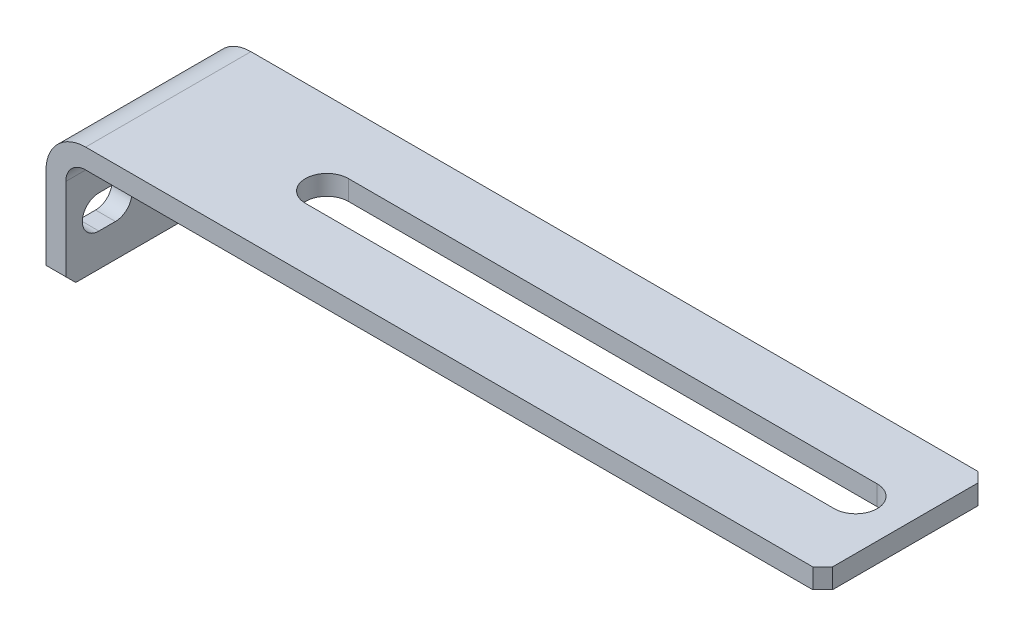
ISO-10303-21;
HEADER;
FILE_DESCRIPTION(('STEP AP214'),'2;1');
FILE_NAME('part.step','',(''),(''),'','','');
FILE_SCHEMA(('AUTOMOTIVE_DESIGN { 1 0 10303 214 1 1 1 1 }'));
ENDSEC;
DATA;
#1=APPLICATION_CONTEXT('core data for automotive mechanical design processes');
#2=APPLICATION_PROTOCOL_DEFINITION('international standard','automotive_design',2000,#1);
#3=PRODUCT_CONTEXT('',#1,'mechanical');
#4=PRODUCT('Part','Part','',(#3));
#5=PRODUCT_RELATED_PRODUCT_CATEGORY('part','',(#4));
#6=PRODUCT_DEFINITION_FORMATION('','',#4);
#7=PRODUCT_DEFINITION_CONTEXT('part definition',#1,'design');
#8=PRODUCT_DEFINITION('design','',#6,#7);
#9=PRODUCT_DEFINITION_SHAPE('','',#8);
#10=(LENGTH_UNIT() NAMED_UNIT(*) SI_UNIT(.MILLI.,.METRE.));
#11=(NAMED_UNIT(*) PLANE_ANGLE_UNIT() SI_UNIT($,.RADIAN.));
#12=(NAMED_UNIT(*) SI_UNIT($,.STERADIAN.) SOLID_ANGLE_UNIT());
#13=UNCERTAINTY_MEASURE_WITH_UNIT(LENGTH_MEASURE(1.E-05),#10,'distance_accuracy_value','');
#14=(GEOMETRIC_REPRESENTATION_CONTEXT(3) GLOBAL_UNCERTAINTY_ASSIGNED_CONTEXT((#13)) GLOBAL_UNIT_ASSIGNED_CONTEXT((#10,
#11,#12)) REPRESENTATION_CONTEXT('',''));
#15=CARTESIAN_POINT('',(0.,0.,0.));
#16=DIRECTION('',(0.,0.,1.));
#17=DIRECTION('',(1.,0.,0.));
#18=AXIS2_PLACEMENT_3D('',#15,#16,#17);
#19=CARTESIAN_POINT('',(111.5,0.,25.));
#20=DIRECTION('',(-1.,0.,0.));
#21=DIRECTION('',(0.,-1.,0.));
#22=AXIS2_PLACEMENT_3D('',#19,#20,#21);
#23=PLANE('',#22);
#24=DIRECTION('',(0.,0.,-1.));
#25=VECTOR('',#24,1.);
#26=CARTESIAN_POINT('',(111.5,-6.,25.));
#27=LINE('',#26,#25);
#28=CARTESIAN_POINT('',(111.5,-6.,22.));
#29=VERTEX_POINT('',#28);
#30=CARTESIAN_POINT('',(111.5,-6.,-22.));
#31=VERTEX_POINT('',#30);
#32=EDGE_CURVE('E300',#29,#31,#27,.T.);
#33=ORIENTED_EDGE('',*,*,#32,.T.);
#34=DIRECTION('',(0.,1.,0.));
#35=VECTOR('',#34,1.);
#36=CARTESIAN_POINT('',(111.5,0.,-22.));
#37=LINE('',#36,#35);
#38=CARTESIAN_POINT('',(111.5,0.,-22.));
#39=VERTEX_POINT('',#38);
#40=EDGE_CURVE('E349',#31,#39,#37,.T.);
#41=ORIENTED_EDGE('',*,*,#40,.T.);
#42=DIRECTION('',(0.,0.,-1.));
#43=VECTOR('',#42,1.);
#44=CARTESIAN_POINT('',(111.5,0.,25.));
#45=LINE('',#44,#43);
#46=CARTESIAN_POINT('',(111.5,0.,22.));
#47=VERTEX_POINT('',#46);
#48=EDGE_CURVE('E321',#47,#39,#45,.T.);
#49=ORIENTED_EDGE('',*,*,#48,.F.);
#50=DIRECTION('',(0.,-1.,0.));
#51=VECTOR('',#50,1.);
#52=CARTESIAN_POINT('',(111.5,0.,22.));
#53=LINE('',#52,#51);
#54=EDGE_CURVE('E347',#47,#29,#53,.T.);
#55=ORIENTED_EDGE('',*,*,#54,.T.);
#56=EDGE_LOOP('',(#33,#41,#49,#55));
#57=FACE_BOUND('',#56,.T.);
#58=ADVANCED_FACE('F23',(#57),#23,.F.);
#59=CARTESIAN_POINT('',(-111.5,0.,25.));
#60=DIRECTION('',(0.,-1.,0.));
#61=DIRECTION('',(1.,0.,0.));
#62=AXIS2_PLACEMENT_3D('',#59,#60,#61);
#63=PLANE('',#62);
#64=DIRECTION('',(-1.,0.,0.));
#65=VECTOR('',#64,1.);
#66=CARTESIAN_POINT('',(96.5,0.,-6.5));
#67=LINE('',#66,#65);
#68=CARTESIAN_POINT('',(96.5,0.,-6.5));
#69=VERTEX_POINT('',#68);
#70=CARTESIAN_POINT('',(-63.5,0.,-6.5));
#71=VERTEX_POINT('',#70);
#72=EDGE_CURVE('E254',#69,#71,#67,.T.);
#73=ORIENTED_EDGE('',*,*,#72,.F.);
#74=CARTESIAN_POINT('',(96.5,0.,0.));
#75=DIRECTION('',(0.,1.,0.));
#76=DIRECTION('',(-1.,0.,0.));
#77=AXIS2_PLACEMENT_3D('',#74,#75,#76);
#78=CIRCLE('',#77,6.5);
#79=CARTESIAN_POINT('',(96.5,0.,6.5));
#80=VERTEX_POINT('',#79);
#81=EDGE_CURVE('E252',#80,#69,#78,.T.);
#82=ORIENTED_EDGE('',*,*,#81,.F.);
#83=DIRECTION('',(1.,0.,0.));
#84=VECTOR('',#83,1.);
#85=CARTESIAN_POINT('',(-63.5,0.,6.5));
#86=LINE('',#85,#84);
#87=CARTESIAN_POINT('',(-63.5,0.,6.5));
#88=VERTEX_POINT('',#87);
#89=EDGE_CURVE('E260',#88,#80,#86,.T.);
#90=ORIENTED_EDGE('',*,*,#89,.F.);
#91=CARTESIAN_POINT('',(-63.5,0.,0.));
#92=DIRECTION('',(0.,1.,0.));
#93=DIRECTION('',(-1.,0.,0.));
#94=AXIS2_PLACEMENT_3D('',#91,#92,#93);
#95=CIRCLE('',#94,6.5);
#96=EDGE_CURVE('E257',#71,#88,#95,.T.);
#97=ORIENTED_EDGE('',*,*,#96,.F.);
#98=EDGE_LOOP('',(#73,#82,#90,#97));
#99=FACE_BOUND('',#98,.T.);
#100=ORIENTED_EDGE('',*,*,#48,.T.);
#101=DIRECTION('',(-0.707106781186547,0.,-0.707106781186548));
#102=VECTOR('',#101,1.);
#103=CARTESIAN_POINT('',(111.5,0.,-22.));
#104=LINE('',#103,#102);
#105=CARTESIAN_POINT('',(108.5,0.,-25.));
#106=VERTEX_POINT('',#105);
#107=EDGE_CURVE('E354',#39,#106,#104,.T.);
#108=ORIENTED_EDGE('',*,*,#107,.T.);
#109=DIRECTION('',(-1.,0.,0.));
#110=VECTOR('',#109,1.);
#111=CARTESIAN_POINT('',(-111.5,0.,-25.));
#112=LINE('',#111,#110);
#113=CARTESIAN_POINT('',(-111.5,0.,-25.));
#114=VERTEX_POINT('',#113);
#115=EDGE_CURVE('E266',#106,#114,#112,.T.);
#116=ORIENTED_EDGE('',*,*,#115,.T.);
#117=DIRECTION('',(0.,0.,-1.));
#118=VECTOR('',#117,1.);
#119=CARTESIAN_POINT('',(-111.5,0.,25.));
#120=LINE('',#119,#118);
#121=CARTESIAN_POINT('',(-111.5,0.,25.));
#122=VERTEX_POINT('',#121);
#123=EDGE_CURVE('E318',#122,#114,#120,.T.);
#124=ORIENTED_EDGE('',*,*,#123,.F.);
#125=DIRECTION('',(-1.,0.,0.));
#126=VECTOR('',#125,1.);
#127=CARTESIAN_POINT('',(-111.5,0.,25.));
#128=LINE('',#127,#126);
#129=CARTESIAN_POINT('',(108.5,0.,25.));
#130=VERTEX_POINT('',#129);
#131=EDGE_CURVE('E286',#130,#122,#128,.T.);
#132=ORIENTED_EDGE('',*,*,#131,.F.);
#133=DIRECTION('',(-0.707106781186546,0.,0.70710678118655));
#134=VECTOR('',#133,1.);
#135=CARTESIAN_POINT('',(108.5,0.,25.));
#136=LINE('',#135,#134);
#137=EDGE_CURVE('E352',#130,#47,#136,.F.);
#138=ORIENTED_EDGE('',*,*,#137,.T.);
#139=EDGE_LOOP('',(#100,#108,#116,#124,#132,#138));
#140=FACE_BOUND('',#139,.T.);
#141=ADVANCED_FACE('F381',(#99,#140),#63,.F.);
#142=CARTESIAN_POINT('',(-111.5,-12.,25.));
#143=DIRECTION('',(0.,0.,-1.));
#144=DIRECTION('',(-1.,0.,0.));
#145=AXIS2_PLACEMENT_3D('',#142,#143,#144);
#146=CYLINDRICAL_SURFACE('',#145,12.);
#147=CARTESIAN_POINT('',(-111.5,-12.,-25.));
#148=DIRECTION('',(0.,0.,1.));
#149=DIRECTION('',(-1.,0.,0.));
#150=AXIS2_PLACEMENT_3D('',#147,#148,#149);
#151=CIRCLE('',#150,12.);
#152=CARTESIAN_POINT('',(-123.5,-12.,-25.));
#153=VERTEX_POINT('',#152);
#154=EDGE_CURVE('E274',#114,#153,#151,.T.);
#155=ORIENTED_EDGE('',*,*,#154,.T.);
#156=DIRECTION('',(0.,0.,-1.));
#157=VECTOR('',#156,1.);
#158=CARTESIAN_POINT('',(-123.5,-12.,25.));
#159=LINE('',#158,#157);
#160=CARTESIAN_POINT('',(-123.5,-12.,25.));
#161=VERTEX_POINT('',#160);
#162=EDGE_CURVE('E315',#161,#153,#159,.T.);
#163=ORIENTED_EDGE('',*,*,#162,.F.);
#164=CARTESIAN_POINT('',(-111.5,-12.,25.));
#165=DIRECTION('',(0.,0.,1.));
#166=DIRECTION('',(-1.,0.,0.));
#167=AXIS2_PLACEMENT_3D('',#164,#165,#166);
#168=CIRCLE('',#167,12.);
#169=EDGE_CURVE('E288',#122,#161,#168,.T.);
#170=ORIENTED_EDGE('',*,*,#169,.F.);
#171=ORIENTED_EDGE('',*,*,#123,.T.);
#172=EDGE_LOOP('',(#155,#163,#170,#171));
#173=FACE_BOUND('',#172,.T.);
#174=ADVANCED_FACE('F408',(#173),#146,.T.);
#175=CARTESIAN_POINT('',(-123.5,-40.,25.));
#176=DIRECTION('',(1.,0.,0.));
#177=DIRECTION('',(0.,0.,-1.));
#178=AXIS2_PLACEMENT_3D('',#175,#176,#177);
#179=PLANE('',#178);
#180=DIRECTION('',(0.,0.,1.));
#181=VECTOR('',#180,1.);
#182=CARTESIAN_POINT('',(-123.5,-20.,25.));
#183=LINE('',#182,#181);
#184=CARTESIAN_POINT('',(-123.5,-20.,-15.));
#185=VERTEX_POINT('',#184);
#186=CARTESIAN_POINT('',(-123.5,-20.,-10.));
#187=VERTEX_POINT('',#186);
#188=EDGE_CURVE('E214',#185,#187,#183,.T.);
#189=ORIENTED_EDGE('',*,*,#188,.T.);
#190=CARTESIAN_POINT('',(-123.5,-25.,-10.));
#191=DIRECTION('',(1.,0.,0.));
#192=DIRECTION('',(0.,0.,-1.));
#193=AXIS2_PLACEMENT_3D('',#190,#191,#192);
#194=CIRCLE('',#193,5.);
#195=CARTESIAN_POINT('',(-123.5,-30.,-10.));
#196=VERTEX_POINT('',#195);
#197=EDGE_CURVE('E217',#187,#196,#194,.T.);
#198=ORIENTED_EDGE('',*,*,#197,.T.);
#199=DIRECTION('',(0.,0.,-1.));
#200=VECTOR('',#199,1.);
#201=CARTESIAN_POINT('',(-123.5,-30.,25.));
#202=LINE('',#201,#200);
#203=CARTESIAN_POINT('',(-123.5,-30.,-15.));
#204=VERTEX_POINT('',#203);
#205=EDGE_CURVE('E209',#196,#204,#202,.T.);
#206=ORIENTED_EDGE('',*,*,#205,.T.);
#207=CARTESIAN_POINT('',(-123.5,-25.,-15.));
#208=DIRECTION('',(1.,0.,0.));
#209=DIRECTION('',(0.,0.,-1.));
#210=AXIS2_PLACEMENT_3D('',#207,#208,#209);
#211=CIRCLE('',#210,5.);
#212=EDGE_CURVE('E189',#204,#185,#211,.T.);
#213=ORIENTED_EDGE('',*,*,#212,.T.);
#214=EDGE_LOOP('',(#189,#198,#206,#213));
#215=FACE_BOUND('',#214,.T.);
#216=DIRECTION('',(0.,0.,1.));
#217=VECTOR('',#216,1.);
#218=CARTESIAN_POINT('',(-123.5,-20.,25.));
#219=LINE('',#218,#217);
#220=CARTESIAN_POINT('',(-123.5,-20.,10.));
#221=VERTEX_POINT('',#220);
#222=CARTESIAN_POINT('',(-123.5,-20.,15.));
#223=VERTEX_POINT('',#222);
#224=EDGE_CURVE('E246',#221,#223,#219,.T.);
#225=ORIENTED_EDGE('',*,*,#224,.T.);
#226=CARTESIAN_POINT('',(-123.5,-25.,15.));
#227=DIRECTION('',(1.,0.,0.));
#228=DIRECTION('',(0.,0.,-1.));
#229=AXIS2_PLACEMENT_3D('',#226,#227,#228);
#230=CIRCLE('',#229,5.);
#231=CARTESIAN_POINT('',(-123.5,-30.,15.));
#232=VERTEX_POINT('',#231);
#233=EDGE_CURVE('E249',#223,#232,#230,.T.);
#234=ORIENTED_EDGE('',*,*,#233,.T.);
#235=DIRECTION('',(0.,0.,-1.));
#236=VECTOR('',#235,1.);
#237=CARTESIAN_POINT('',(-123.5,-30.,25.));
#238=LINE('',#237,#236);
#239=CARTESIAN_POINT('',(-123.5,-30.,10.));
#240=VERTEX_POINT('',#239);
#241=EDGE_CURVE('E234',#232,#240,#238,.T.);
#242=ORIENTED_EDGE('',*,*,#241,.T.);
#243=CARTESIAN_POINT('',(-123.5,-25.,10.));
#244=DIRECTION('',(1.,0.,0.));
#245=DIRECTION('',(0.,0.,-1.));
#246=AXIS2_PLACEMENT_3D('',#243,#244,#245);
#247=CIRCLE('',#246,5.);
#248=EDGE_CURVE('E243',#240,#221,#247,.T.);
#249=ORIENTED_EDGE('',*,*,#248,.T.);
#250=EDGE_LOOP('',(#225,#234,#242,#249));
#251=FACE_BOUND('',#250,.T.);
#252=DIRECTION('',(0.,-1.,0.));
#253=VECTOR('',#252,1.);
#254=CARTESIAN_POINT('',(-123.5,-40.,-25.));
#255=LINE('',#254,#253);
#256=CARTESIAN_POINT('',(-123.5,-37.,-25.));
#257=VERTEX_POINT('',#256);
#258=EDGE_CURVE('E276',#153,#257,#255,.T.);
#259=ORIENTED_EDGE('',*,*,#258,.T.);
#260=DIRECTION('',(0.,-0.707106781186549,0.707106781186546));
#261=VECTOR('',#260,1.);
#262=CARTESIAN_POINT('',(-123.5,-40.,-22.));
#263=LINE('',#262,#261);
#264=CARTESIAN_POINT('',(-123.5,-40.,-22.));
#265=VERTEX_POINT('',#264);
#266=EDGE_CURVE('E339',#257,#265,#263,.T.);
#267=ORIENTED_EDGE('',*,*,#266,.T.);
#268=DIRECTION('',(0.,0.,-1.));
#269=VECTOR('',#268,1.);
#270=CARTESIAN_POINT('',(-123.5,-40.,25.));
#271=LINE('',#270,#269);
#272=CARTESIAN_POINT('',(-123.5,-40.,22.));
#273=VERTEX_POINT('',#272);
#274=EDGE_CURVE('E312',#273,#265,#271,.T.);
#275=ORIENTED_EDGE('',*,*,#274,.F.);
#276=DIRECTION('',(0.,-0.707106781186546,-0.70710678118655));
#277=VECTOR('',#276,1.);
#278=CARTESIAN_POINT('',(-123.5,-37.,25.));
#279=LINE('',#278,#277);
#280=CARTESIAN_POINT('',(-123.5,-37.,25.));
#281=VERTEX_POINT('',#280);
#282=EDGE_CURVE('E337',#273,#281,#279,.F.);
#283=ORIENTED_EDGE('',*,*,#282,.T.);
#284=DIRECTION('',(0.,-1.,0.));
#285=VECTOR('',#284,1.);
#286=CARTESIAN_POINT('',(-123.5,-40.,25.));
#287=LINE('',#286,#285);
#288=EDGE_CURVE('E290',#161,#281,#287,.T.);
#289=ORIENTED_EDGE('',*,*,#288,.F.);
#290=ORIENTED_EDGE('',*,*,#162,.T.);
#291=EDGE_LOOP('',(#259,#267,#275,#283,#289,#290));
#292=FACE_BOUND('',#291,.T.);
#293=ADVANCED_FACE('F431',(#215,#251,#292),#179,.F.);
#294=CARTESIAN_POINT('',(-117.5,-40.,25.));
#295=DIRECTION('',(0.,1.,0.));
#296=DIRECTION('',(0.,0.,1.));
#297=AXIS2_PLACEMENT_3D('',#294,#295,#296);
#298=PLANE('',#297);
#299=ORIENTED_EDGE('',*,*,#274,.T.);
#300=DIRECTION('',(1.,0.,0.));
#301=VECTOR('',#300,1.);
#302=CARTESIAN_POINT('',(-117.5,-40.,-22.));
#303=LINE('',#302,#301);
#304=CARTESIAN_POINT('',(-117.5,-40.,-22.));
#305=VERTEX_POINT('',#304);
#306=EDGE_CURVE('E326',#265,#305,#303,.T.);
#307=ORIENTED_EDGE('',*,*,#306,.T.);
#308=DIRECTION('',(0.,0.,-1.));
#309=VECTOR('',#308,1.);
#310=CARTESIAN_POINT('',(-117.5,-40.,25.));
#311=LINE('',#310,#309);
#312=CARTESIAN_POINT('',(-117.5,-40.,22.));
#313=VERTEX_POINT('',#312);
#314=EDGE_CURVE('E309',#313,#305,#311,.T.);
#315=ORIENTED_EDGE('',*,*,#314,.F.);
#316=DIRECTION('',(-1.,0.,0.));
#317=VECTOR('',#316,1.);
#318=CARTESIAN_POINT('',(-117.5,-40.,22.));
#319=LINE('',#318,#317);
#320=EDGE_CURVE('E324',#313,#273,#319,.T.);
#321=ORIENTED_EDGE('',*,*,#320,.T.);
#322=EDGE_LOOP('',(#299,#307,#315,#321));
#323=FACE_BOUND('',#322,.T.);
#324=ADVANCED_FACE('F446',(#323),#298,.F.);
#325=CARTESIAN_POINT('',(-117.5,-12.,25.));
#326=DIRECTION('',(-1.,0.,0.));
#327=DIRECTION('',(0.,0.,1.));
#328=AXIS2_PLACEMENT_3D('',#325,#326,#327);
#329=PLANE('',#328);
#330=DIRECTION('',(0.,0.,-1.));
#331=VECTOR('',#330,1.);
#332=CARTESIAN_POINT('',(-117.5,-30.,-10.));
#333=LINE('',#332,#331);
#334=CARTESIAN_POINT('',(-117.5,-30.,-10.));
#335=VERTEX_POINT('',#334);
#336=CARTESIAN_POINT('',(-117.5,-30.,-15.));
#337=VERTEX_POINT('',#336);
#338=EDGE_CURVE('E195',#335,#337,#333,.T.);
#339=ORIENTED_EDGE('',*,*,#338,.F.);
#340=CARTESIAN_POINT('',(-117.5,-25.,-10.));
#341=DIRECTION('',(1.,0.,0.));
#342=DIRECTION('',(0.,0.,-1.));
#343=AXIS2_PLACEMENT_3D('',#340,#341,#342);
#344=CIRCLE('',#343,5.);
#345=CARTESIAN_POINT('',(-117.5,-20.,-10.));
#346=VERTEX_POINT('',#345);
#347=EDGE_CURVE('E45',#346,#335,#344,.T.);
#348=ORIENTED_EDGE('',*,*,#347,.F.);
#349=DIRECTION('',(0.,0.,1.));
#350=VECTOR('',#349,1.);
#351=CARTESIAN_POINT('',(-117.5,-20.,-15.));
#352=LINE('',#351,#350);
#353=CARTESIAN_POINT('',(-117.5,-20.,-15.));
#354=VERTEX_POINT('',#353);
#355=EDGE_CURVE('E202',#354,#346,#352,.T.);
#356=ORIENTED_EDGE('',*,*,#355,.F.);
#357=CARTESIAN_POINT('',(-117.5,-25.,-15.));
#358=DIRECTION('',(1.,0.,0.));
#359=DIRECTION('',(0.,0.,-1.));
#360=AXIS2_PLACEMENT_3D('',#357,#358,#359);
#361=CIRCLE('',#360,5.);
#362=EDGE_CURVE('E186',#337,#354,#361,.T.);
#363=ORIENTED_EDGE('',*,*,#362,.F.);
#364=EDGE_LOOP('',(#339,#348,#356,#363));
#365=FACE_BOUND('',#364,.T.);
#366=DIRECTION('',(0.,0.,-1.));
#367=VECTOR('',#366,1.);
#368=CARTESIAN_POINT('',(-117.5,-30.,15.));
#369=LINE('',#368,#367);
#370=CARTESIAN_POINT('',(-117.5,-30.,15.));
#371=VERTEX_POINT('',#370);
#372=CARTESIAN_POINT('',(-117.5,-30.,10.));
#373=VERTEX_POINT('',#372);
#374=EDGE_CURVE('E222',#371,#373,#369,.T.);
#375=ORIENTED_EDGE('',*,*,#374,.F.);
#376=CARTESIAN_POINT('',(-117.5,-25.,15.));
#377=DIRECTION('',(1.,0.,0.));
#378=DIRECTION('',(0.,0.,-1.));
#379=AXIS2_PLACEMENT_3D('',#376,#377,#378);
#380=CIRCLE('',#379,5.);
#381=CARTESIAN_POINT('',(-117.5,-20.,15.));
#382=VERTEX_POINT('',#381);
#383=EDGE_CURVE('E220',#382,#371,#380,.T.);
#384=ORIENTED_EDGE('',*,*,#383,.F.);
#385=DIRECTION('',(0.,0.,1.));
#386=VECTOR('',#385,1.);
#387=CARTESIAN_POINT('',(-117.5,-20.,10.));
#388=LINE('',#387,#386);
#389=CARTESIAN_POINT('',(-117.5,-20.,10.));
#390=VERTEX_POINT('',#389);
#391=EDGE_CURVE('E228',#390,#382,#388,.T.);
#392=ORIENTED_EDGE('',*,*,#391,.F.);
#393=CARTESIAN_POINT('',(-117.5,-25.,10.));
#394=DIRECTION('',(1.,0.,0.));
#395=DIRECTION('',(0.,0.,-1.));
#396=AXIS2_PLACEMENT_3D('',#393,#394,#395);
#397=CIRCLE('',#396,5.);
#398=EDGE_CURVE('E225',#373,#390,#397,.T.);
#399=ORIENTED_EDGE('',*,*,#398,.F.);
#400=EDGE_LOOP('',(#375,#384,#392,#399));
#401=FACE_BOUND('',#400,.T.);
#402=ORIENTED_EDGE('',*,*,#314,.T.);
#403=DIRECTION('',(0.,0.707106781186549,-0.707106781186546));
#404=VECTOR('',#403,1.);
#405=CARTESIAN_POINT('',(-117.5,-40.,-22.));
#406=LINE('',#405,#404);
#407=CARTESIAN_POINT('',(-117.5,-37.,-25.));
#408=VERTEX_POINT('',#407);
#409=EDGE_CURVE('E331',#305,#408,#406,.T.);
#410=ORIENTED_EDGE('',*,*,#409,.T.);
#411=DIRECTION('',(0.,1.,0.));
#412=VECTOR('',#411,1.);
#413=CARTESIAN_POINT('',(-117.5,-12.,-25.));
#414=LINE('',#413,#412);
#415=CARTESIAN_POINT('',(-117.5,-12.,-25.));
#416=VERTEX_POINT('',#415);
#417=EDGE_CURVE('E279',#408,#416,#414,.T.);
#418=ORIENTED_EDGE('',*,*,#417,.T.);
#419=DIRECTION('',(0.,0.,-1.));
#420=VECTOR('',#419,1.);
#421=CARTESIAN_POINT('',(-117.5,-12.,25.));
#422=LINE('',#421,#420);
#423=CARTESIAN_POINT('',(-117.5,-12.,25.));
#424=VERTEX_POINT('',#423);
#425=EDGE_CURVE('E306',#424,#416,#422,.T.);
#426=ORIENTED_EDGE('',*,*,#425,.F.);
#427=DIRECTION('',(0.,1.,0.));
#428=VECTOR('',#427,1.);
#429=CARTESIAN_POINT('',(-117.5,-12.,25.));
#430=LINE('',#429,#428);
#431=CARTESIAN_POINT('',(-117.5,-37.,25.));
#432=VERTEX_POINT('',#431);
#433=EDGE_CURVE('E293',#432,#424,#430,.T.);
#434=ORIENTED_EDGE('',*,*,#433,.F.);
#435=DIRECTION('',(0.,0.707106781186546,0.70710678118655));
#436=VECTOR('',#435,1.);
#437=CARTESIAN_POINT('',(-117.5,-37.,25.));
#438=LINE('',#437,#436);
#439=EDGE_CURVE('E329',#432,#313,#438,.F.);
#440=ORIENTED_EDGE('',*,*,#439,.T.);
#441=EDGE_LOOP('',(#402,#410,#418,#426,#434,#440));
#442=FACE_BOUND('',#441,.T.);
#443=ADVANCED_FACE('F199',(#365,#401,#442),#329,.F.);
#444=CARTESIAN_POINT('',(-111.5,-12.,25.));
#445=DIRECTION('',(0.,0.,-1.));
#446=DIRECTION('',(-1.,0.,0.));
#447=AXIS2_PLACEMENT_3D('',#444,#445,#446);
#448=CYLINDRICAL_SURFACE('',#447,6.);
#449=CARTESIAN_POINT('',(-111.5,-12.,-25.));
#450=DIRECTION('',(0.,0.,-1.));
#451=DIRECTION('',(-1.,0.,0.));
#452=AXIS2_PLACEMENT_3D('',#449,#450,#451);
#453=CIRCLE('',#452,6.);
#454=CARTESIAN_POINT('',(-111.5,-6.,-25.));
#455=VERTEX_POINT('',#454);
#456=EDGE_CURVE('E281',#416,#455,#453,.T.);
#457=ORIENTED_EDGE('',*,*,#456,.T.);
#458=DIRECTION('',(0.,0.,-1.));
#459=VECTOR('',#458,1.);
#460=CARTESIAN_POINT('',(-111.5,-6.,25.));
#461=LINE('',#460,#459);
#462=CARTESIAN_POINT('',(-111.5,-6.,25.));
#463=VERTEX_POINT('',#462);
#464=EDGE_CURVE('E303',#463,#455,#461,.T.);
#465=ORIENTED_EDGE('',*,*,#464,.F.);
#466=CARTESIAN_POINT('',(-111.5,-12.,25.));
#467=DIRECTION('',(0.,0.,-1.));
#468=DIRECTION('',(-1.,0.,0.));
#469=AXIS2_PLACEMENT_3D('',#466,#467,#468);
#470=CIRCLE('',#469,6.);
#471=EDGE_CURVE('E295',#424,#463,#470,.T.);
#472=ORIENTED_EDGE('',*,*,#471,.F.);
#473=ORIENTED_EDGE('',*,*,#425,.T.);
#474=EDGE_LOOP('',(#457,#465,#472,#473));
#475=FACE_BOUND('',#474,.T.);
#476=ADVANCED_FACE('F454',(#475),#448,.F.);
#477=CARTESIAN_POINT('',(111.5,-6.,25.));
#478=DIRECTION('',(0.,1.,0.));
#479=DIRECTION('',(-1.,0.,0.));
#480=AXIS2_PLACEMENT_3D('',#477,#478,#479);
#481=PLANE('',#480);
#482=DIRECTION('',(1.,0.,0.));
#483=VECTOR('',#482,1.);
#484=CARTESIAN_POINT('',(111.5,-6.,6.5));
#485=LINE('',#484,#483);
#486=CARTESIAN_POINT('',(-63.5,-6.,6.5));
#487=VERTEX_POINT('',#486);
#488=CARTESIAN_POINT('',(96.5,-6.,6.5));
#489=VERTEX_POINT('',#488);
#490=EDGE_CURVE('E30',#487,#489,#485,.T.);
#491=ORIENTED_EDGE('',*,*,#490,.T.);
#492=CARTESIAN_POINT('',(96.5,-6.,0.));
#493=DIRECTION('',(0.,1.,0.));
#494=DIRECTION('',(-1.,0.,0.));
#495=AXIS2_PLACEMENT_3D('',#492,#493,#494);
#496=CIRCLE('',#495,6.5);
#497=CARTESIAN_POINT('',(96.5,-6.,-6.5));
#498=VERTEX_POINT('',#497);
#499=EDGE_CURVE('E13',#489,#498,#496,.T.);
#500=ORIENTED_EDGE('',*,*,#499,.T.);
#501=DIRECTION('',(-1.,0.,0.));
#502=VECTOR('',#501,1.);
#503=CARTESIAN_POINT('',(111.5,-6.,-6.5));
#504=LINE('',#503,#502);
#505=CARTESIAN_POINT('',(-63.5,-6.,-6.5));
#506=VERTEX_POINT('',#505);
#507=EDGE_CURVE('E360',#498,#506,#504,.T.);
#508=ORIENTED_EDGE('',*,*,#507,.T.);
#509=CARTESIAN_POINT('',(-63.5,-6.,0.));
#510=DIRECTION('',(0.,1.,0.));
#511=DIRECTION('',(-1.,0.,0.));
#512=AXIS2_PLACEMENT_3D('',#509,#510,#511);
#513=CIRCLE('',#512,6.5);
#514=EDGE_CURVE('E363',#506,#487,#513,.T.);
#515=ORIENTED_EDGE('',*,*,#514,.T.);
#516=EDGE_LOOP('',(#491,#500,#508,#515));
#517=FACE_BOUND('',#516,.T.);
#518=DIRECTION('',(1.,0.,0.));
#519=VECTOR('',#518,1.);
#520=CARTESIAN_POINT('',(111.5,-6.,-25.));
#521=LINE('',#520,#519);
#522=CARTESIAN_POINT('',(108.5,-6.,-25.));
#523=VERTEX_POINT('',#522);
#524=EDGE_CURVE('E283',#455,#523,#521,.T.);
#525=ORIENTED_EDGE('',*,*,#524,.T.);
#526=DIRECTION('',(0.707106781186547,0.,0.707106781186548));
#527=VECTOR('',#526,1.);
#528=CARTESIAN_POINT('',(111.5,-6.,-22.));
#529=LINE('',#528,#527);
#530=EDGE_CURVE('E358',#523,#31,#529,.T.);
#531=ORIENTED_EDGE('',*,*,#530,.T.);
#532=ORIENTED_EDGE('',*,*,#32,.F.);
#533=DIRECTION('',(0.707106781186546,0.,-0.70710678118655));
#534=VECTOR('',#533,1.);
#535=CARTESIAN_POINT('',(108.5,-6.,25.));
#536=LINE('',#535,#534);
#537=CARTESIAN_POINT('',(108.5,-6.,25.));
#538=VERTEX_POINT('',#537);
#539=EDGE_CURVE('E356',#29,#538,#536,.F.);
#540=ORIENTED_EDGE('',*,*,#539,.T.);
#541=DIRECTION('',(1.,0.,0.));
#542=VECTOR('',#541,1.);
#543=CARTESIAN_POINT('',(111.5,-6.,25.));
#544=LINE('',#543,#542);
#545=EDGE_CURVE('E297',#463,#538,#544,.T.);
#546=ORIENTED_EDGE('',*,*,#545,.F.);
#547=ORIENTED_EDGE('',*,*,#464,.T.);
#548=EDGE_LOOP('',(#525,#531,#532,#540,#546,#547));
#549=FACE_BOUND('',#548,.T.);
#550=ADVANCED_FACE('F367',(#517,#549),#481,.F.);
#551=CARTESIAN_POINT('',(-111.5,-12.,25.));
#552=DIRECTION('',(0.,0.,-1.));
#553=DIRECTION('',(-1.,0.,0.));
#554=AXIS2_PLACEMENT_3D('',#551,#552,#553);
#555=PLANE('',#554);
#556=ORIENTED_EDGE('',*,*,#288,.T.);
#557=DIRECTION('',(1.,0.,0.));
#558=VECTOR('',#557,1.);
#559=CARTESIAN_POINT('',(-111.5,-37.,25.));
#560=LINE('',#559,#558);
#561=EDGE_CURVE('E344',#281,#432,#560,.T.);
#562=ORIENTED_EDGE('',*,*,#561,.T.);
#563=ORIENTED_EDGE('',*,*,#433,.T.);
#564=ORIENTED_EDGE('',*,*,#471,.T.);
#565=ORIENTED_EDGE('',*,*,#545,.T.);
#566=DIRECTION('',(0.,1.,0.));
#567=VECTOR('',#566,1.);
#568=CARTESIAN_POINT('',(108.5,-11.9999999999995,25.));
#569=LINE('',#568,#567);
#570=EDGE_CURVE('E341',#538,#130,#569,.T.);
#571=ORIENTED_EDGE('',*,*,#570,.T.);
#572=ORIENTED_EDGE('',*,*,#131,.T.);
#573=ORIENTED_EDGE('',*,*,#169,.T.);
#574=EDGE_LOOP('',(#556,#562,#563,#564,#565,#571,#572,#573));
#575=FACE_BOUND('',#574,.T.);
#576=ADVANCED_FACE('F437',(#575),#555,.F.);
#577=CARTESIAN_POINT('',(-111.5,-12.,-25.));
#578=DIRECTION('',(0.,0.,-1.));
#579=DIRECTION('',(-1.,0.,0.));
#580=AXIS2_PLACEMENT_3D('',#577,#578,#579);
#581=PLANE('',#580);
#582=ORIENTED_EDGE('',*,*,#417,.F.);
#583=DIRECTION('',(-1.,0.,0.));
#584=VECTOR('',#583,1.);
#585=CARTESIAN_POINT('',(-123.5,-37.,-25.));
#586=LINE('',#585,#584);
#587=EDGE_CURVE('E335',#408,#257,#586,.T.);
#588=ORIENTED_EDGE('',*,*,#587,.T.);
#589=ORIENTED_EDGE('',*,*,#258,.F.);
#590=ORIENTED_EDGE('',*,*,#154,.F.);
#591=ORIENTED_EDGE('',*,*,#115,.F.);
#592=DIRECTION('',(0.,-1.,0.));
#593=VECTOR('',#592,1.);
#594=CARTESIAN_POINT('',(108.5,-6.,-25.));
#595=LINE('',#594,#593);
#596=EDGE_CURVE('E333',#106,#523,#595,.T.);
#597=ORIENTED_EDGE('',*,*,#596,.T.);
#598=ORIENTED_EDGE('',*,*,#524,.F.);
#599=ORIENTED_EDGE('',*,*,#456,.F.);
#600=EDGE_LOOP('',(#582,#588,#589,#590,#591,#597,#598,#599));
#601=FACE_BOUND('',#600,.T.);
#602=ADVANCED_FACE('F423',(#601),#581,.T.);
#603=CARTESIAN_POINT('',(-117.5,-40.,-22.));
#604=DIRECTION('',(0.,-0.707106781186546,-0.707106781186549));
#605=DIRECTION('',(0.,0.707106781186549,-0.707106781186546));
#606=AXIS2_PLACEMENT_3D('',#603,#604,#605);
#607=PLANE('',#606);
#608=ORIENTED_EDGE('',*,*,#266,.F.);
#609=ORIENTED_EDGE('',*,*,#587,.F.);
#610=ORIENTED_EDGE('',*,*,#409,.F.);
#611=ORIENTED_EDGE('',*,*,#306,.F.);
#612=EDGE_LOOP('',(#608,#609,#610,#611));
#613=FACE_BOUND('',#612,.T.);
#614=ADVANCED_FACE('F449',(#613),#607,.T.);
#615=CARTESIAN_POINT('',(-111.5,-37.,25.));
#616=DIRECTION('',(0.,0.70710678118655,-0.707106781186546));
#617=DIRECTION('',(0.,0.707106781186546,0.70710678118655));
#618=AXIS2_PLACEMENT_3D('',#615,#616,#617);
#619=PLANE('',#618);
#620=ORIENTED_EDGE('',*,*,#282,.F.);
#621=ORIENTED_EDGE('',*,*,#320,.F.);
#622=ORIENTED_EDGE('',*,*,#439,.F.);
#623=ORIENTED_EDGE('',*,*,#561,.F.);
#624=EDGE_LOOP('',(#620,#621,#622,#623));
#625=FACE_BOUND('',#624,.T.);
#626=ADVANCED_FACE('F440',(#625),#619,.F.);
#627=CARTESIAN_POINT('',(111.5,0.,-22.));
#628=DIRECTION('',(0.707106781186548,0.,-0.707106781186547));
#629=DIRECTION('',(-0.707106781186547,0.,-0.707106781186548));
#630=AXIS2_PLACEMENT_3D('',#627,#628,#629);
#631=PLANE('',#630);
#632=ORIENTED_EDGE('',*,*,#530,.F.);
#633=ORIENTED_EDGE('',*,*,#596,.F.);
#634=ORIENTED_EDGE('',*,*,#107,.F.);
#635=ORIENTED_EDGE('',*,*,#40,.F.);
#636=EDGE_LOOP('',(#632,#633,#634,#635));
#637=FACE_BOUND('',#636,.T.);
#638=ADVANCED_FACE('F416',(#637),#631,.T.);
#639=CARTESIAN_POINT('',(108.5,-11.9999999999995,25.));
#640=DIRECTION('',(-0.70710678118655,0.,-0.707106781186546));
#641=DIRECTION('',(-0.707106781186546,0.,0.70710678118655));
#642=AXIS2_PLACEMENT_3D('',#639,#640,#641);
#643=PLANE('',#642);
#644=ORIENTED_EDGE('',*,*,#539,.F.);
#645=ORIENTED_EDGE('',*,*,#54,.F.);
#646=ORIENTED_EDGE('',*,*,#137,.F.);
#647=ORIENTED_EDGE('',*,*,#570,.F.);
#648=EDGE_LOOP('',(#644,#645,#646,#647));
#649=FACE_BOUND('',#648,.T.);
#650=ADVANCED_FACE('F460',(#649),#643,.F.);
#651=CARTESIAN_POINT('',(96.5,-50.,0.));
#652=DIRECTION('',(0.,1.,0.));
#653=DIRECTION('',(-1.,0.,0.));
#654=AXIS2_PLACEMENT_3D('',#651,#652,#653);
#655=CYLINDRICAL_SURFACE('',#654,6.5);
#656=DIRECTION('',(0.,1.,0.));
#657=VECTOR('',#656,1.);
#658=CARTESIAN_POINT('',(96.5,-50.,6.5));
#659=LINE('',#658,#657);
#660=EDGE_CURVE('E264',#489,#80,#659,.T.);
#661=ORIENTED_EDGE('',*,*,#660,.T.);
#662=ORIENTED_EDGE('',*,*,#81,.T.);
#663=DIRECTION('',(0.,1.,0.));
#664=VECTOR('',#663,1.);
#665=CARTESIAN_POINT('',(96.5,-50.,-6.5));
#666=LINE('',#665,#664);
#667=EDGE_CURVE('E263',#498,#69,#666,.T.);
#668=ORIENTED_EDGE('',*,*,#667,.F.);
#669=ORIENTED_EDGE('',*,*,#499,.F.);
#670=EDGE_LOOP('',(#661,#662,#668,#669));
#671=FACE_BOUND('',#670,.T.);
#672=ADVANCED_FACE('F385',(#671),#655,.F.);
#673=CARTESIAN_POINT('',(-63.5,-50.,6.5));
#674=DIRECTION('',(0.,0.,1.));
#675=DIRECTION('',(1.,0.,0.));
#676=AXIS2_PLACEMENT_3D('',#673,#674,#675);
#677=PLANE('',#676);
#678=DIRECTION('',(0.,1.,0.));
#679=VECTOR('',#678,1.);
#680=CARTESIAN_POINT('',(-63.5,-50.,6.5));
#681=LINE('',#680,#679);
#682=EDGE_CURVE('E267',#487,#88,#681,.T.);
#683=ORIENTED_EDGE('',*,*,#682,.T.);
#684=ORIENTED_EDGE('',*,*,#89,.T.);
#685=ORIENTED_EDGE('',*,*,#660,.F.);
#686=ORIENTED_EDGE('',*,*,#490,.F.);
#687=EDGE_LOOP('',(#683,#684,#685,#686));
#688=FACE_BOUND('',#687,.T.);
#689=ADVANCED_FACE('F373',(#688),#677,.F.);
#690=CARTESIAN_POINT('',(-63.5,-50.,0.));
#691=DIRECTION('',(0.,1.,0.));
#692=DIRECTION('',(-1.,0.,0.));
#693=AXIS2_PLACEMENT_3D('',#690,#691,#692);
#694=CYLINDRICAL_SURFACE('',#693,6.5);
#695=DIRECTION('',(0.,1.,0.));
#696=VECTOR('',#695,1.);
#697=CARTESIAN_POINT('',(-63.5,-50.,-6.5));
#698=LINE('',#697,#696);
#699=EDGE_CURVE('E269',#506,#71,#698,.T.);
#700=ORIENTED_EDGE('',*,*,#699,.T.);
#701=ORIENTED_EDGE('',*,*,#96,.T.);
#702=ORIENTED_EDGE('',*,*,#682,.F.);
#703=ORIENTED_EDGE('',*,*,#514,.F.);
#704=EDGE_LOOP('',(#700,#701,#702,#703));
#705=FACE_BOUND('',#704,.T.);
#706=ADVANCED_FACE('F375',(#705),#694,.F.);
#707=CARTESIAN_POINT('',(96.5,-50.,-6.5));
#708=DIRECTION('',(0.,0.,-1.));
#709=DIRECTION('',(-1.,0.,0.));
#710=AXIS2_PLACEMENT_3D('',#707,#708,#709);
#711=PLANE('',#710);
#712=ORIENTED_EDGE('',*,*,#667,.T.);
#713=ORIENTED_EDGE('',*,*,#72,.T.);
#714=ORIENTED_EDGE('',*,*,#699,.F.);
#715=ORIENTED_EDGE('',*,*,#507,.F.);
#716=EDGE_LOOP('',(#712,#713,#714,#715));
#717=FACE_BOUND('',#716,.T.);
#718=ADVANCED_FACE('F387',(#717),#711,.F.);
#719=CARTESIAN_POINT('',(-167.5,-25.,15.));
#720=DIRECTION('',(1.,0.,0.));
#721=DIRECTION('',(0.,0.,-1.));
#722=AXIS2_PLACEMENT_3D('',#719,#720,#721);
#723=CYLINDRICAL_SURFACE('',#722,5.);
#724=DIRECTION('',(1.,0.,0.));
#725=VECTOR('',#724,1.);
#726=CARTESIAN_POINT('',(-167.5,-20.,15.));
#727=LINE('',#726,#725);
#728=EDGE_CURVE('E232',#223,#382,#727,.T.);
#729=ORIENTED_EDGE('',*,*,#728,.T.);
#730=ORIENTED_EDGE('',*,*,#383,.T.);
#731=DIRECTION('',(1.,0.,0.));
#732=VECTOR('',#731,1.);
#733=CARTESIAN_POINT('',(-167.5,-30.,15.));
#734=LINE('',#733,#732);
#735=EDGE_CURVE('E231',#232,#371,#734,.T.);
#736=ORIENTED_EDGE('',*,*,#735,.F.);
#737=ORIENTED_EDGE('',*,*,#233,.F.);
#738=EDGE_LOOP('',(#729,#730,#736,#737));
#739=FACE_BOUND('',#738,.T.);
#740=ADVANCED_FACE('F389',(#739),#723,.F.);
#741=CARTESIAN_POINT('',(-167.5,-20.,10.));
#742=DIRECTION('',(0.,1.,0.));
#743=DIRECTION('',(0.,0.,1.));
#744=AXIS2_PLACEMENT_3D('',#741,#742,#743);
#745=PLANE('',#744);
#746=DIRECTION('',(1.,0.,0.));
#747=VECTOR('',#746,1.);
#748=CARTESIAN_POINT('',(-167.5,-20.,10.));
#749=LINE('',#748,#747);
#750=EDGE_CURVE('E235',#221,#390,#749,.T.);
#751=ORIENTED_EDGE('',*,*,#750,.T.);
#752=ORIENTED_EDGE('',*,*,#391,.T.);
#753=ORIENTED_EDGE('',*,*,#728,.F.);
#754=ORIENTED_EDGE('',*,*,#224,.F.);
#755=EDGE_LOOP('',(#751,#752,#753,#754));
#756=FACE_BOUND('',#755,.T.);
#757=ADVANCED_FACE('F397',(#756),#745,.F.);
#758=CARTESIAN_POINT('',(-167.5,-25.,10.));
#759=DIRECTION('',(1.,0.,0.));
#760=DIRECTION('',(0.,0.,-1.));
#761=AXIS2_PLACEMENT_3D('',#758,#759,#760);
#762=CYLINDRICAL_SURFACE('',#761,5.);
#763=DIRECTION('',(1.,0.,0.));
#764=VECTOR('',#763,1.);
#765=CARTESIAN_POINT('',(-167.5,-30.,10.));
#766=LINE('',#765,#764);
#767=EDGE_CURVE('E237',#240,#373,#766,.T.);
#768=ORIENTED_EDGE('',*,*,#767,.T.);
#769=ORIENTED_EDGE('',*,*,#398,.T.);
#770=ORIENTED_EDGE('',*,*,#750,.F.);
#771=ORIENTED_EDGE('',*,*,#248,.F.);
#772=EDGE_LOOP('',(#768,#769,#770,#771));
#773=FACE_BOUND('',#772,.T.);
#774=ADVANCED_FACE('F565',(#773),#762,.F.);
#775=CARTESIAN_POINT('',(-167.5,-30.,15.));
#776=DIRECTION('',(0.,-1.,0.));
#777=DIRECTION('',(0.,0.,-1.));
#778=AXIS2_PLACEMENT_3D('',#775,#776,#777);
#779=PLANE('',#778);
#780=ORIENTED_EDGE('',*,*,#735,.T.);
#781=ORIENTED_EDGE('',*,*,#374,.T.);
#782=ORIENTED_EDGE('',*,*,#767,.F.);
#783=ORIENTED_EDGE('',*,*,#241,.F.);
#784=EDGE_LOOP('',(#780,#781,#782,#783));
#785=FACE_BOUND('',#784,.T.);
#786=ADVANCED_FACE('F573',(#785),#779,.F.);
#787=CARTESIAN_POINT('',(-167.5,-25.,-10.));
#788=DIRECTION('',(1.,0.,0.));
#789=DIRECTION('',(0.,0.,-1.));
#790=AXIS2_PLACEMENT_3D('',#787,#788,#789);
#791=CYLINDRICAL_SURFACE('',#790,5.);
#792=DIRECTION('',(1.,0.,0.));
#793=VECTOR('',#792,1.);
#794=CARTESIAN_POINT('',(-167.5,-20.,-10.));
#795=LINE('',#794,#793);
#796=EDGE_CURVE('E207',#187,#346,#795,.T.);
#797=ORIENTED_EDGE('',*,*,#796,.T.);
#798=ORIENTED_EDGE('',*,*,#347,.T.);
#799=DIRECTION('',(1.,0.,0.));
#800=VECTOR('',#799,1.);
#801=CARTESIAN_POINT('',(-167.5,-30.,-10.));
#802=LINE('',#801,#800);
#803=EDGE_CURVE('E192',#196,#335,#802,.T.);
#804=ORIENTED_EDGE('',*,*,#803,.F.);
#805=ORIENTED_EDGE('',*,*,#197,.F.);
#806=EDGE_LOOP('',(#797,#798,#804,#805));
#807=FACE_BOUND('',#806,.T.);
#808=ADVANCED_FACE('F581',(#807),#791,.F.);
#809=CARTESIAN_POINT('',(-167.5,-20.,-15.));
#810=DIRECTION('',(0.,1.,0.));
#811=DIRECTION('',(0.,0.,1.));
#812=AXIS2_PLACEMENT_3D('',#809,#810,#811);
#813=PLANE('',#812);
#814=DIRECTION('',(1.,0.,0.));
#815=VECTOR('',#814,1.);
#816=CARTESIAN_POINT('',(-167.5,-20.,-15.));
#817=LINE('',#816,#815);
#818=EDGE_CURVE('E191',#185,#354,#817,.T.);
#819=ORIENTED_EDGE('',*,*,#818,.T.);
#820=ORIENTED_EDGE('',*,*,#355,.T.);
#821=ORIENTED_EDGE('',*,*,#796,.F.);
#822=ORIENTED_EDGE('',*,*,#188,.F.);
#823=EDGE_LOOP('',(#819,#820,#821,#822));
#824=FACE_BOUND('',#823,.T.);
#825=ADVANCED_FACE('F589',(#824),#813,.F.);
#826=CARTESIAN_POINT('',(-167.5,-25.,-15.));
#827=DIRECTION('',(1.,0.,0.));
#828=DIRECTION('',(0.,0.,-1.));
#829=AXIS2_PLACEMENT_3D('',#826,#827,#828);
#830=CYLINDRICAL_SURFACE('',#829,5.);
#831=DIRECTION('',(1.,0.,0.));
#832=VECTOR('',#831,1.);
#833=CARTESIAN_POINT('',(-167.5,-30.,-15.));
#834=LINE('',#833,#832);
#835=EDGE_CURVE('E37',#204,#337,#834,.T.);
#836=ORIENTED_EDGE('',*,*,#835,.T.);
#837=ORIENTED_EDGE('',*,*,#362,.T.);
#838=ORIENTED_EDGE('',*,*,#818,.F.);
#839=ORIENTED_EDGE('',*,*,#212,.F.);
#840=EDGE_LOOP('',(#836,#837,#838,#839));
#841=FACE_BOUND('',#840,.T.);
#842=ADVANCED_FACE('F183',(#841),#830,.F.);
#843=CARTESIAN_POINT('',(-167.5,-30.,-10.));
#844=DIRECTION('',(0.,-1.,0.));
#845=DIRECTION('',(0.,0.,-1.));
#846=AXIS2_PLACEMENT_3D('',#843,#844,#845);
#847=PLANE('',#846);
#848=ORIENTED_EDGE('',*,*,#803,.T.);
#849=ORIENTED_EDGE('',*,*,#338,.T.);
#850=ORIENTED_EDGE('',*,*,#835,.F.);
#851=ORIENTED_EDGE('',*,*,#205,.F.);
#852=EDGE_LOOP('',(#848,#849,#850,#851));
#853=FACE_BOUND('',#852,.T.);
#854=ADVANCED_FACE('F196',(#853),#847,.F.);
#855=CLOSED_SHELL('',(#58,#141,#174,#293,#324,#443,#476,#550,#576,#602,#614,#626,#638,#650,#672,
#689,#706,#718,#740,#757,#774,#786,#808,#825,#842,#854));
#856=MANIFOLD_SOLID_BREP('B1',#855);
#857=ADVANCED_BREP_SHAPE_REPRESENTATION('',(#18,#856),#14);
#858=SHAPE_DEFINITION_REPRESENTATION(#9,#857);
ENDSEC;
END-ISO-10303-21;
